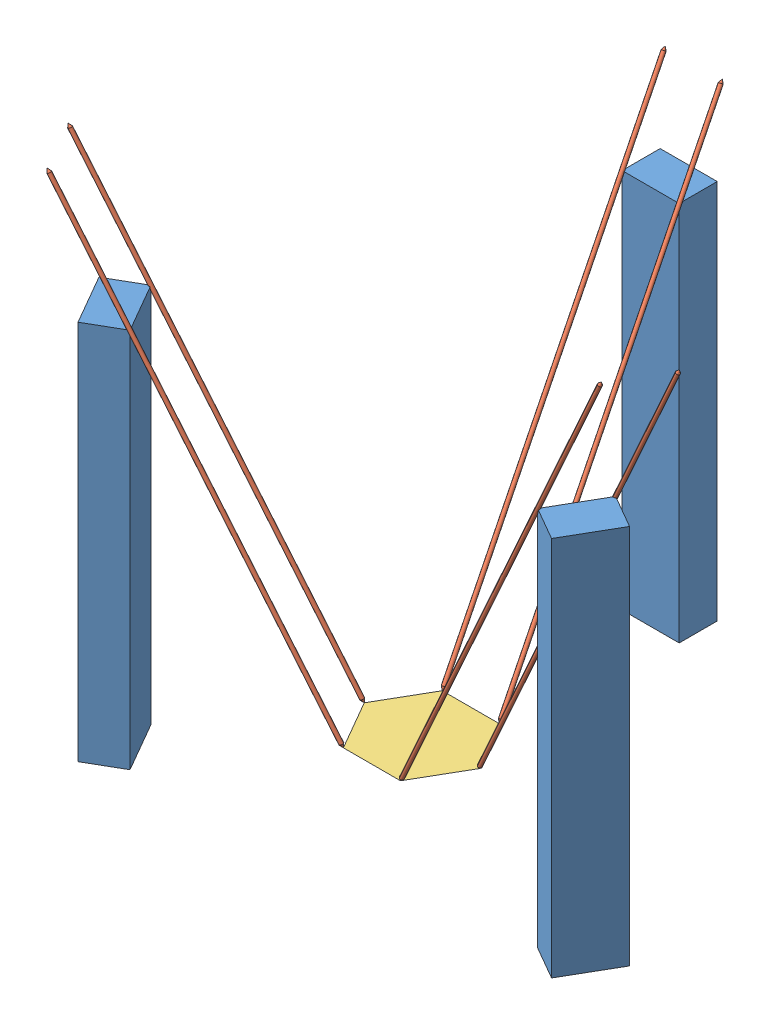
SolidWorks assembly esquema de tensigriti.SLDASM, configuration Predeterminado (file format 7000). Lengths in mm.
Overall size (287.19 274.02 243.82).
8 component instances, 3 part files, 14 mates.
Components (placement in the parent):
- railes-1: railes.SLDPRT [Predeterminado] at (-68.2927 -96.1287 252.8461) size (252.85 200 231.96)
- hilo-1: hilo.SLDPRT [Predeterminado] at (-21.2744 -52.7112 287.2963) x (0.910803 -0.405624 -0.076855) z (0.07442 -0.021797 0.996989) size (2 253.46 2)
- hilo-2: hilo.SLDPRT [Predeterminado] at (-36.2744 -52.7112 313.2771) x (0.551982 -0.254278 -0.794141) z (0.728297 -0.316779 0.607646) size (2 253.46 2)
- hilo-3: hilo.SLDPRT [Predeterminado] at (-37.2429 -52.9544 260.268) x (0.964752 -0.017833 -0.262556) z (0.214027 0.633686 0.743394) size (2 253.46 2)
- hilo-4: hilo.SLDPRT [Predeterminado] at (-67.2429 -52.9544 260.268) x (-0.909383 -0.353905 -0.218572) z (0.386751 -0.525954 -0.757494) size (2 253.46 2)
- hilo-5: hilo.SLDPRT [Predeterminado] at (-82.8118 -52.7934 287.5437) x (-0.490886 -0.39188 0.778114) z (-0.726037 -0.309662 -0.613987) size (2 253.46 2)
- hilo-6: hilo.SLDPRT [Predeterminado] at (-67.8118 -52.7934 313.5245) x (-0.477429 -0.132524 -0.868619) z (0.734956 0.481557 -0.477432) size (2 253.46 2)
- base-2: base.SLDPRT [Predeterminado] at (-51.9777 -54.2939 287.3142) x (0.85246 0 0.522793) z (0.522793 0 -0.85246) size (52.74 15 59.98)
Mates (geometry in assembly coordinates):
- Coincidente1: coincident: point of railes-1; line of hilo-1 through (80.2451 175.7338 284.7129) axis (-0.406078 -0.91378 0.010334)
- Coincidente2: coincident: point of railes-1; line of hilo-2 through (65.2451 175.7338 310.6937) axis (-0.406078 -0.91378 0.010334)
- Coincidente3: coincident: point of railes-1; line of hilo-3 through (-75.5234 140.3919 106.4764) axis (0.153122 -0.773385 0.615166)
- Coincidente4: coincident: point of railes-1; line of hilo-4 through (-105.5234 140.3919 106.4764) axis (0.153122 -0.773385 0.615166)
- Coincidente5: coincident: point of railes-1; line of hilo-5 through (-203.2021 163.7909 320.6713) axis (0.481561 -0.866337 -0.13251)
- Coincidente6: coincident: point of railes-1; line of hilo-6 through (-188.2021 163.7909 346.6521) axis (0.481561 -0.866337 -0.13251)
- Coincidente11: coincident: point of base-2; point of hilo-2
- Coincidente17: coincident: point of hilo-1; point of base-2
- Coincidente18: coincident: point of hilo-3; point of base-2
- Coincidente19: coincident: point of hilo-4; point of base-2
- Coincidente20: coincident: point of hilo-5; point of base-2
- Coincidente21: coincident: point of hilo-6; point of base-2
- Paralelo3: parallel aligned: plane of railes-1 through (-68.2927 103.8713 252.8461) normal (0 1 0); plane of base-2 through (-51.9777 -54.2939 287.3142) normal (0 1 0)
- Paralelo4: parallel anti-aligned: line of railes-1 through (-169.8952 103.8713 311.5064) axis (0.5 0 0.866025); line of base-2 through (-66.9777 -54.2939 313.295) axis (-0.5 0 -0.866025)
